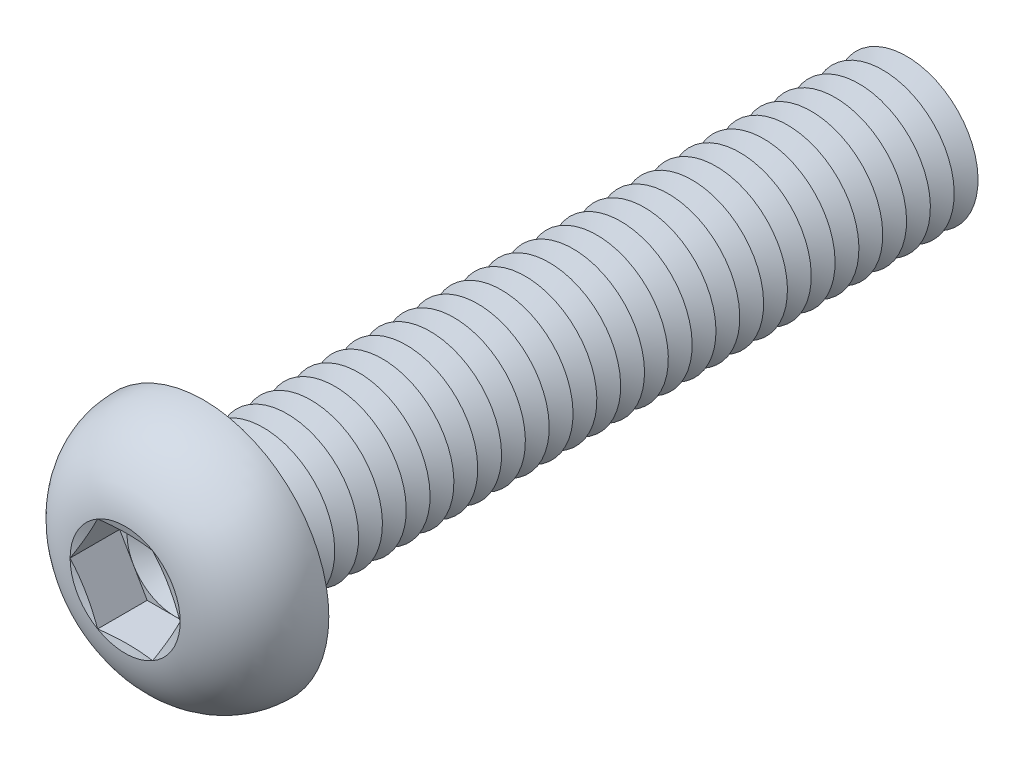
from build123d import *

# Parameters (mm, degrees)
FILLET1_R          = 0.5
LPATTERN1_COUNT    = 30
LPATTERN1_PITCH    = 1
CUT_EXTRUDE1_DEPTH = 2.08


with BuildPart() as part:
    # Sketch1 → Revolve1 (revolve)
    with BuildSketch(Plane(origin=(0, 0, 0), x_dir=(0, 0, -1), z_dir=(1, 0, 0))):
        with BuildLine():
            Line((0, 3), (0, 5.25))
            ThreePointArc((0, 5.25), (-2.210041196, 4.408189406), (-3.3, 2.3094))
            Line((-3.3, 2.3094), (-2.990599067, 1.1547))
            Line((-2.990599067, 1.1547), (-3.3, 1.1547))
            Line((-3.3, 1.1547), (-3.3, 0))
            Line((-3.3, 0), (30, 0))
            Line((30, 0), (30, 3))
            Line((30, 3), (0, 3))
        make_face()
    revolve(axis=Axis((0, 0, -30), (0, 0, 1)))

    # Fillet1
    fillet1_edges = [part.edges().sort_by_distance(p)[0] for p in [
        (0, -3, 0),
    ]]
    fillet(fillet1_edges, radius=FILLET1_R)

    # Sketch2 → Cut-Revolve1 (revolve, cut)
    with BuildSketch(Plane(origin=(0, 0, 0), x_dir=(0, 0, -1), z_dir=(1, 0, 0))):
        Polygon((29.5, 3), (30.5, 3), (30, 2.133974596), align=None)
    cut_revolve1 = revolve(axis=Axis((0, 0, -30), (0, 0, -1)), mode=Mode.SUBTRACT)

    # LPattern1: Cut-Revolve1 ×30
    with Locations(*[(0, 0, i * LPATTERN1_PITCH) for i in range(1, LPATTERN1_COUNT)]):
        add(cut_revolve1, mode=Mode.SUBTRACT)

    # Sketch3 → Cut-Extrude1 (cut)
    with BuildSketch(Plane.XY.offset(3.3)):
        Polygon((1.1547, 1.999999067), (-1.1547, 1.999999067), (-2.3094, 0), (-1.1547, -1.999999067), (1.1547, -1.999999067), (2.3094, 0), align=None)
    extrude(amount=-CUT_EXTRUDE1_DEPTH, mode=Mode.SUBTRACT)

    # Cut-Extrude2 cone 1 section (on through the dimple's axis) → Cut-Extrude2 (revolve, cut)
    with BuildSketch(Plane(origin=(0, 0, 1.22), x_dir=(0, -1, 0), z_dir=(1, 0, 0))):
        Polygon((0, 0), (1.999999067, 0), (0, 1.1547), align=None)
    revolve(axis=Axis((0, 0, 1.22), (0, 0, -1)), mode=Mode.SUBTRACT)


solid = part.part
